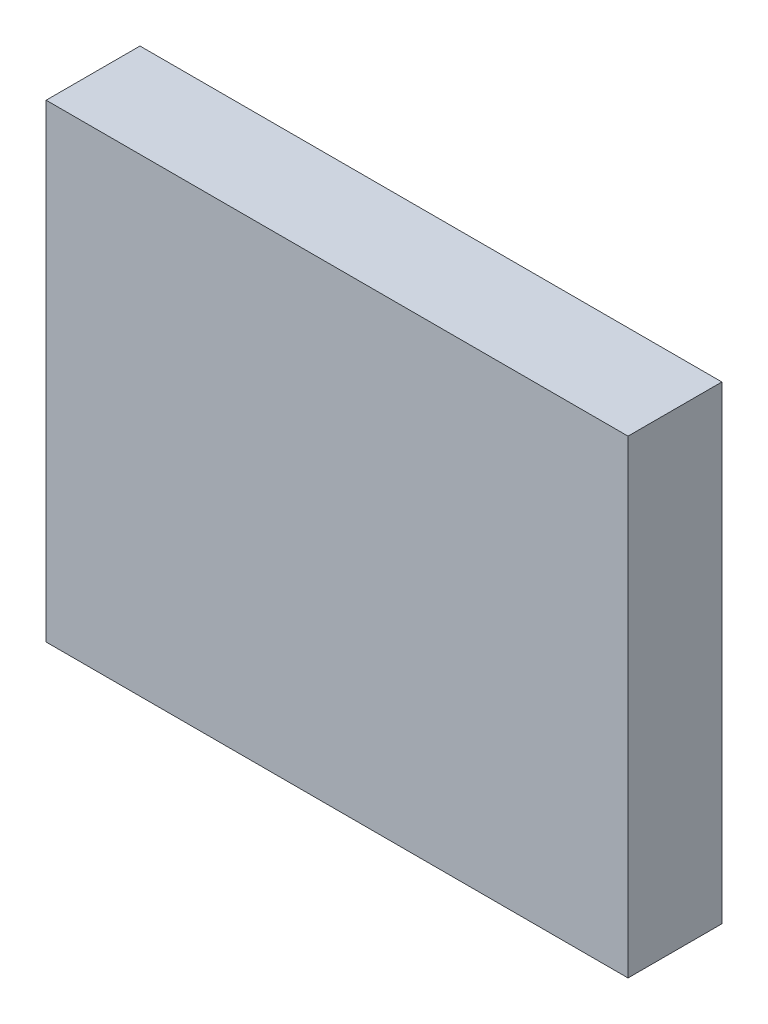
from build123d import *

# Parameters (mm, degrees)
ESQUISSE1_W        = 62
ESQUISSE1_H        = 50
BOSS_EXTRU_1_DEPTH = 10


with BuildPart() as part:
    # Esquisse1 → Boss.-Extru.1 (new body)
    with BuildSketch(Plane.XY):
        with Locations((31, 25)):
            Rectangle(ESQUISSE1_W, ESQUISSE1_H)
    extrude(amount=BOSS_EXTRU_1_DEPTH)


solid = part.part
